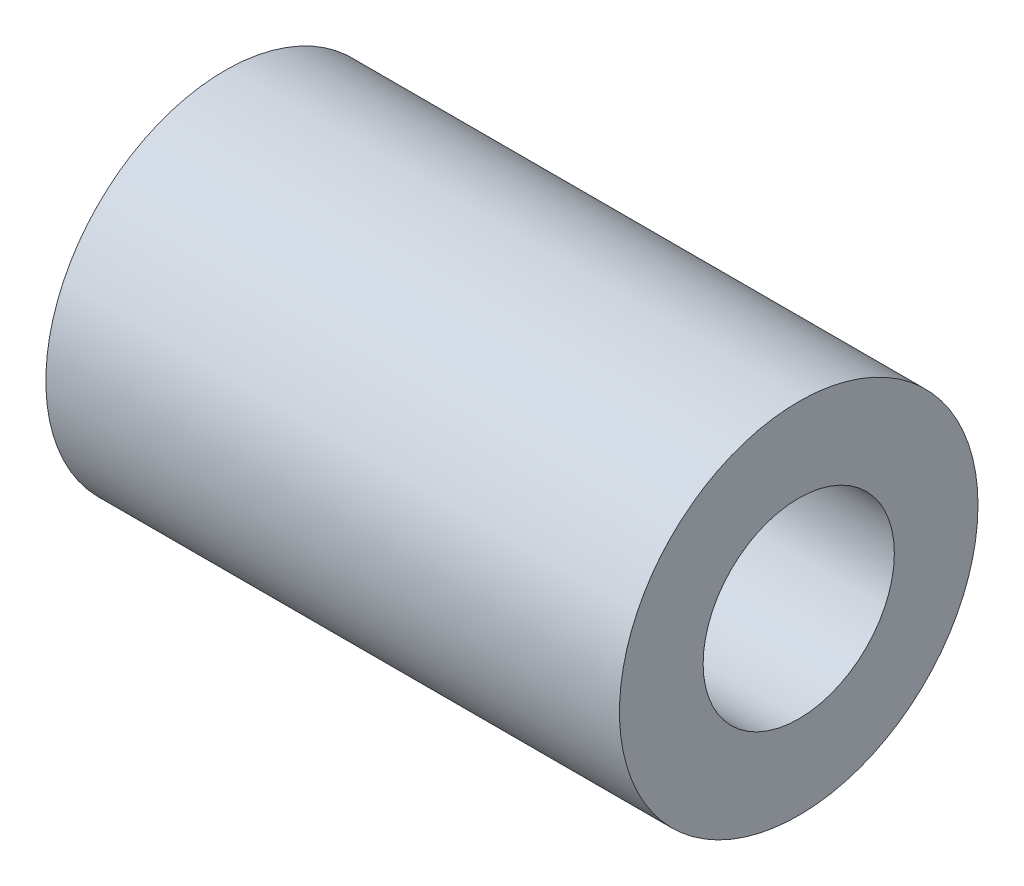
from build123d import *

# Parameters (mm, degrees)
SKIZZE1_R                       = 7.5
SKIZZE1_R_2                     = 4
AUFSATZ_LINEAR_AUSTRAGEN1_DEPTH = 12


with BuildPart() as part:
    # Skizze1 → Aufsatz-Linear austragen1 (new, symmetric)
    with BuildSketch(Plane(origin=(0, 0, 0), x_dir=(0, 0, -1), z_dir=(1, 0, 0))):
        Circle(SKIZZE1_R)
        Circle(SKIZZE1_R_2, mode=Mode.SUBTRACT)
    extrude(amount=AUFSATZ_LINEAR_AUSTRAGEN1_DEPTH, both=True)


solid = part.part
